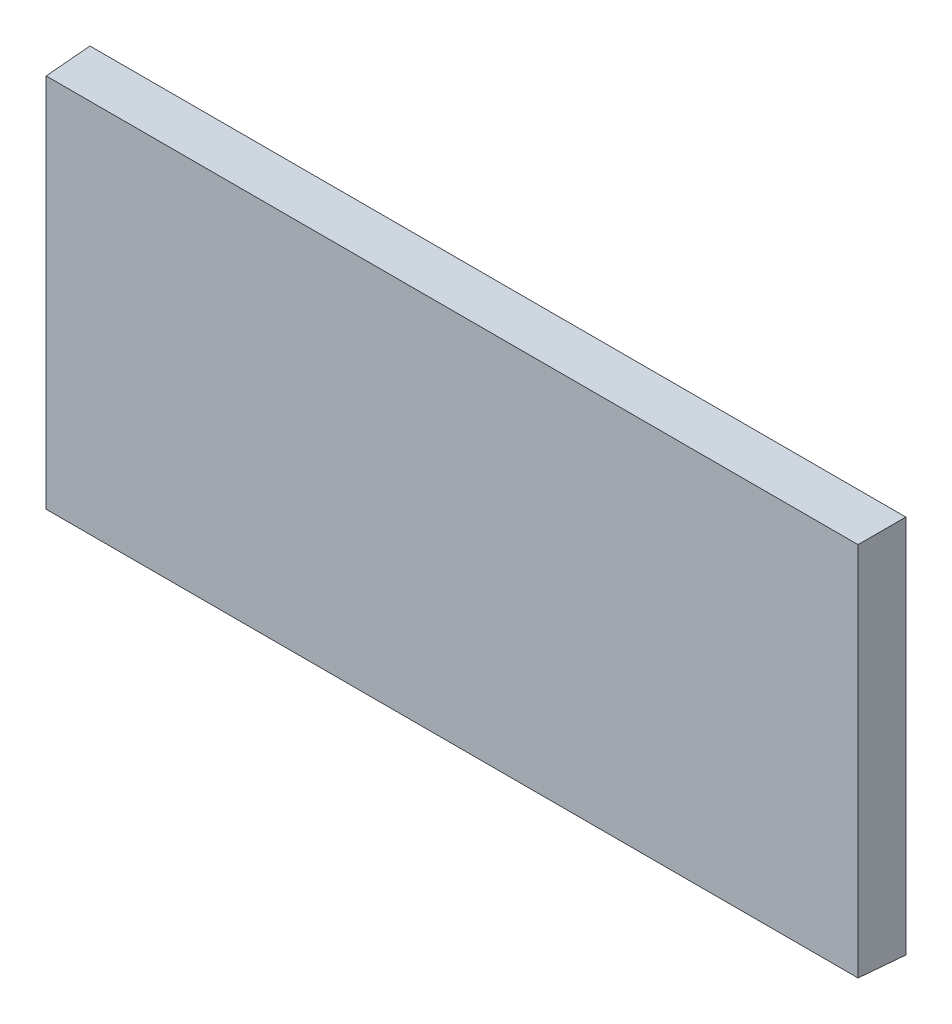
ISO-10303-21;
HEADER;
FILE_DESCRIPTION(('STEP AP214'),'2;1');
FILE_NAME('part.step','',(''),(''),'','','');
FILE_SCHEMA(('AUTOMOTIVE_DESIGN { 1 0 10303 214 1 1 1 1 }'));
ENDSEC;
DATA;
#1=APPLICATION_CONTEXT('core data for automotive mechanical design processes');
#2=APPLICATION_PROTOCOL_DEFINITION('international standard','automotive_design',2000,#1);
#3=PRODUCT_CONTEXT('',#1,'mechanical');
#4=PRODUCT('Part','Part','',(#3));
#5=PRODUCT_RELATED_PRODUCT_CATEGORY('part','',(#4));
#6=PRODUCT_DEFINITION_FORMATION('','',#4);
#7=PRODUCT_DEFINITION_CONTEXT('part definition',#1,'design');
#8=PRODUCT_DEFINITION('design','',#6,#7);
#9=PRODUCT_DEFINITION_SHAPE('','',#8);
#10=(LENGTH_UNIT() NAMED_UNIT(*) SI_UNIT(.MILLI.,.METRE.));
#11=(NAMED_UNIT(*) PLANE_ANGLE_UNIT() SI_UNIT($,.RADIAN.));
#12=(NAMED_UNIT(*) SI_UNIT($,.STERADIAN.) SOLID_ANGLE_UNIT());
#13=UNCERTAINTY_MEASURE_WITH_UNIT(LENGTH_MEASURE(1.E-05),#10,'distance_accuracy_value','');
#14=(GEOMETRIC_REPRESENTATION_CONTEXT(3) GLOBAL_UNCERTAINTY_ASSIGNED_CONTEXT((#13)) GLOBAL_UNIT_ASSIGNED_CONTEXT((#10,
#11,#12)) REPRESENTATION_CONTEXT('',''));
#15=CARTESIAN_POINT('',(0.,0.,0.));
#16=DIRECTION('',(0.,0.,1.));
#17=DIRECTION('',(1.,0.,0.));
#18=AXIS2_PLACEMENT_3D('',#15,#16,#17);
#19=CARTESIAN_POINT('',(0.,55.32,0.));
#20=DIRECTION('',(0.,0.,-1.));
#21=DIRECTION('',(-1.,0.,0.));
#22=AXIS2_PLACEMENT_3D('',#19,#20,#21);
#23=PLANE('',#22);
#24=DIRECTION('',(0.,-1.,0.));
#25=VECTOR('',#24,1.);
#26=CARTESIAN_POINT('',(0.,0.,0.));
#27=LINE('',#26,#25);
#28=CARTESIAN_POINT('',(0.,55.32,0.));
#29=VERTEX_POINT('',#28);
#30=CARTESIAN_POINT('',(0.,0.,0.));
#31=VERTEX_POINT('',#30);
#32=EDGE_CURVE('E127',#29,#31,#27,.T.);
#33=ORIENTED_EDGE('',*,*,#32,.F.);
#34=DIRECTION('',(-1.,0.,0.));
#35=VECTOR('',#34,1.);
#36=CARTESIAN_POINT('',(0.,55.32,0.));
#37=LINE('',#36,#35);
#38=CARTESIAN_POINT('',(119.,55.32,0.));
#39=VERTEX_POINT('',#38);
#40=EDGE_CURVE('E150',#39,#29,#37,.T.);
#41=ORIENTED_EDGE('',*,*,#40,.F.);
#42=DIRECTION('',(0.,1.,0.));
#43=VECTOR('',#42,1.);
#44=CARTESIAN_POINT('',(119.,0.,0.));
#45=LINE('',#44,#43);
#46=CARTESIAN_POINT('',(119.,0.,0.));
#47=VERTEX_POINT('',#46);
#48=EDGE_CURVE('E148',#47,#39,#45,.T.);
#49=ORIENTED_EDGE('',*,*,#48,.F.);
#50=DIRECTION('',(1.,0.,0.));
#51=VECTOR('',#50,1.);
#52=CARTESIAN_POINT('',(0.,0.,0.));
#53=LINE('',#52,#51);
#54=EDGE_CURVE('E131',#31,#47,#53,.T.);
#55=ORIENTED_EDGE('',*,*,#54,.F.);
#56=EDGE_LOOP('',(#33,#41,#49,#55));
#57=FACE_BOUND('',#56,.T.);
#58=DIRECTION('',(1.,0.,0.));
#59=VECTOR('',#58,1.);
#60=CARTESIAN_POINT('',(0.,53.3180946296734,0.));
#61=LINE('',#60,#59);
#62=CARTESIAN_POINT('',(116.998094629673,53.3180946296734,0.));
#63=VERTEX_POINT('',#62);
#64=CARTESIAN_POINT('',(2.00190537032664,53.3180946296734,0.));
#65=VERTEX_POINT('',#64);
#66=EDGE_CURVE('E122',#63,#65,#61,.F.);
#67=ORIENTED_EDGE('',*,*,#66,.T.);
#68=DIRECTION('',(0.,1.,0.));
#69=VECTOR('',#68,1.);
#70=CARTESIAN_POINT('',(2.00190537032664,55.32,0.));
#71=LINE('',#70,#69);
#72=CARTESIAN_POINT('',(2.00190537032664,2.00190537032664,0.));
#73=VERTEX_POINT('',#72);
#74=EDGE_CURVE('E141',#65,#73,#71,.F.);
#75=ORIENTED_EDGE('',*,*,#74,.T.);
#76=DIRECTION('',(-1.,0.,0.));
#77=VECTOR('',#76,1.);
#78=CARTESIAN_POINT('',(0.,2.00190537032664,0.));
#79=LINE('',#78,#77);
#80=CARTESIAN_POINT('',(116.998094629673,2.00190537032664,0.));
#81=VERTEX_POINT('',#80);
#82=EDGE_CURVE('E126',#73,#81,#79,.F.);
#83=ORIENTED_EDGE('',*,*,#82,.T.);
#84=DIRECTION('',(0.,-1.,0.));
#85=VECTOR('',#84,1.);
#86=CARTESIAN_POINT('',(116.998094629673,55.32,0.));
#87=LINE('',#86,#85);
#88=EDGE_CURVE('E54',#81,#63,#87,.F.);
#89=ORIENTED_EDGE('',*,*,#88,.T.);
#90=EDGE_LOOP('',(#67,#75,#83,#89));
#91=FACE_BOUND('',#90,.T.);
#92=ADVANCED_FACE('F37',(#57,#91),#23,.T.);
#93=CARTESIAN_POINT('',(0.,0.,0.));
#94=DIRECTION('',(-0.999048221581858,0.,0.0436193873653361));
#95=DIRECTION('',(0.0436193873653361,0.,0.999048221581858));
#96=AXIS2_PLACEMENT_3D('',#93,#94,#95);
#97=PLANE('',#96);
#98=ORIENTED_EDGE('',*,*,#32,.T.);
#99=DIRECTION('',(-0.0435779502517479,-0.0435779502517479,-0.998099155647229));
#100=VECTOR('',#99,1.);
#101=CARTESIAN_POINT('',(0.,0.,0.));
#102=LINE('',#101,#100);
#103=CARTESIAN_POINT('',(0.291655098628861,0.291655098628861,6.68));
#104=VERTEX_POINT('',#103);
#105=EDGE_CURVE('E11',#104,#31,#102,.T.);
#106=ORIENTED_EDGE('',*,*,#105,.F.);
#107=DIRECTION('',(0.,1.,0.));
#108=VECTOR('',#107,1.);
#109=CARTESIAN_POINT('',(0.291655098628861,55.32,6.68));
#110=LINE('',#109,#108);
#111=CARTESIAN_POINT('',(0.291655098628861,55.0283449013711,6.68));
#112=VERTEX_POINT('',#111);
#113=EDGE_CURVE('E151',#112,#104,#110,.F.);
#114=ORIENTED_EDGE('',*,*,#113,.F.);
#115=DIRECTION('',(-0.0435779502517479,0.0435779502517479,-0.998099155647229));
#116=VECTOR('',#115,1.);
#117=CARTESIAN_POINT('',(0.105054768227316,55.2149452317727,2.40614978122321));
#118=LINE('',#117,#116);
#119=EDGE_CURVE('E153',#112,#29,#118,.T.);
#120=ORIENTED_EDGE('',*,*,#119,.T.);
#121=EDGE_LOOP('',(#98,#106,#114,#120));
#122=FACE_BOUND('',#121,.T.);
#123=ADVANCED_FACE('F178',(#122),#97,.T.);
#124=CARTESIAN_POINT('',(0.,0.,0.));
#125=DIRECTION('',(0.,-0.999048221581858,0.0436193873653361));
#126=DIRECTION('',(0.,-0.0436193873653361,-0.999048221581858));
#127=AXIS2_PLACEMENT_3D('',#124,#125,#126);
#128=PLANE('',#127);
#129=ORIENTED_EDGE('',*,*,#54,.T.);
#130=DIRECTION('',(0.0435779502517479,-0.0435779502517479,-0.998099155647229));
#131=VECTOR('',#130,1.);
#132=CARTESIAN_POINT('',(119.,0.,0.));
#133=LINE('',#132,#131);
#134=CARTESIAN_POINT('',(118.708344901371,0.291655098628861,6.68));
#135=VERTEX_POINT('',#134);
#136=EDGE_CURVE('E46',#135,#47,#133,.T.);
#137=ORIENTED_EDGE('',*,*,#136,.F.);
#138=DIRECTION('',(-1.,0.,0.));
#139=VECTOR('',#138,1.);
#140=CARTESIAN_POINT('',(0.,0.291655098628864,6.68));
#141=LINE('',#140,#139);
#142=EDGE_CURVE('E162',#104,#135,#141,.F.);
#143=ORIENTED_EDGE('',*,*,#142,.F.);
#144=ORIENTED_EDGE('',*,*,#105,.T.);
#145=EDGE_LOOP('',(#129,#137,#143,#144));
#146=FACE_BOUND('',#145,.T.);
#147=ADVANCED_FACE('F39',(#146),#128,.T.);
#148=CARTESIAN_POINT('',(119.,0.,0.));
#149=DIRECTION('',(0.999048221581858,0.,0.0436193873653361));
#150=DIRECTION('',(0.0436193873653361,0.,-0.999048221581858));
#151=AXIS2_PLACEMENT_3D('',#148,#149,#150);
#152=PLANE('',#151);
#153=ORIENTED_EDGE('',*,*,#48,.T.);
#154=DIRECTION('',(0.0435779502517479,0.0435779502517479,-0.998099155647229));
#155=VECTOR('',#154,1.);
#156=CARTESIAN_POINT('',(118.774014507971,55.0940145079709,5.17591872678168));
#157=LINE('',#156,#155);
#158=CARTESIAN_POINT('',(118.708344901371,55.0283449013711,6.68));
#159=VERTEX_POINT('',#158);
#160=EDGE_CURVE('E156',#159,#39,#157,.T.);
#161=ORIENTED_EDGE('',*,*,#160,.F.);
#162=DIRECTION('',(0.,-1.,0.));
#163=VECTOR('',#162,1.);
#164=CARTESIAN_POINT('',(118.708344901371,55.32,6.68));
#165=LINE('',#164,#163);
#166=EDGE_CURVE('E163',#135,#159,#165,.F.);
#167=ORIENTED_EDGE('',*,*,#166,.F.);
#168=ORIENTED_EDGE('',*,*,#136,.T.);
#169=EDGE_LOOP('',(#153,#161,#167,#168));
#170=FACE_BOUND('',#169,.T.);
#171=ADVANCED_FACE('F169',(#170),#152,.T.);
#172=CARTESIAN_POINT('',(0.,55.32,0.));
#173=DIRECTION('',(0.,0.999048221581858,0.0436193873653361));
#174=DIRECTION('',(0.,-0.0436193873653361,0.999048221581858));
#175=AXIS2_PLACEMENT_3D('',#172,#173,#174);
#176=PLANE('',#175);
#177=ORIENTED_EDGE('',*,*,#40,.T.);
#178=ORIENTED_EDGE('',*,*,#119,.F.);
#179=DIRECTION('',(1.,0.,0.));
#180=VECTOR('',#179,1.);
#181=CARTESIAN_POINT('',(0.,55.0283449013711,6.68));
#182=LINE('',#181,#180);
#183=EDGE_CURVE('E41',#159,#112,#182,.F.);
#184=ORIENTED_EDGE('',*,*,#183,.F.);
#185=ORIENTED_EDGE('',*,*,#160,.T.);
#186=EDGE_LOOP('',(#177,#178,#184,#185));
#187=FACE_BOUND('',#186,.T.);
#188=ADVANCED_FACE('F173',(#187),#176,.T.);
#189=CARTESIAN_POINT('',(0.,55.32,6.68));
#190=DIRECTION('',(0.,0.,-1.));
#191=DIRECTION('',(-1.,0.,0.));
#192=AXIS2_PLACEMENT_3D('',#189,#190,#191);
#193=PLANE('',#192);
#194=ORIENTED_EDGE('',*,*,#113,.T.);
#195=ORIENTED_EDGE('',*,*,#142,.T.);
#196=ORIENTED_EDGE('',*,*,#166,.T.);
#197=ORIENTED_EDGE('',*,*,#183,.T.);
#198=EDGE_LOOP('',(#194,#195,#196,#197));
#199=FACE_BOUND('',#198,.T.);
#200=ADVANCED_FACE('F166',(#199),#193,.F.);
#201=CARTESIAN_POINT('',(1.99809644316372,0.,-0.0872387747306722));
#202=DIRECTION('',(-0.999048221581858,0.,0.0436193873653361));
#203=DIRECTION('',(0.0436193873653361,0.,0.999048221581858));
#204=AXIS2_PLACEMENT_3D('',#201,#202,#203);
#205=PLANE('',#204);
#206=ORIENTED_EDGE('',*,*,#74,.F.);
#207=DIRECTION('',(-0.0435779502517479,0.0435779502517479,-0.998099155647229));
#208=VECTOR('',#207,1.);
#209=CARTESIAN_POINT('',(2.09935675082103,53.220643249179,2.2320035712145));
#210=LINE('',#209,#208);
#211=CARTESIAN_POINT('',(2.20623858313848,53.1137614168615,4.68));
#212=VERTEX_POINT('',#211);
#213=EDGE_CURVE('E121',#212,#65,#210,.T.);
#214=ORIENTED_EDGE('',*,*,#213,.F.);
#215=DIRECTION('',(0.,1.,0.));
#216=VECTOR('',#215,1.);
#217=CARTESIAN_POINT('',(2.20623858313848,55.32,4.68));
#218=LINE('',#217,#216);
#219=CARTESIAN_POINT('',(2.20623858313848,2.20623858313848,4.68));
#220=VERTEX_POINT('',#219);
#221=EDGE_CURVE('E109',#212,#220,#218,.F.);
#222=ORIENTED_EDGE('',*,*,#221,.T.);
#223=DIRECTION('',(-0.0435779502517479,-0.0435779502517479,-0.998099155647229));
#224=VECTOR('',#223,1.);
#225=CARTESIAN_POINT('',(1.99430198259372,1.99430198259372,-0.174146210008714));
#226=LINE('',#225,#224);
#227=EDGE_CURVE('E119',#220,#73,#226,.T.);
#228=ORIENTED_EDGE('',*,*,#227,.T.);
#229=EDGE_LOOP('',(#206,#214,#222,#228));
#230=FACE_BOUND('',#229,.T.);
#231=ADVANCED_FACE('F118',(#230),#205,.F.);
#232=CARTESIAN_POINT('',(0.,1.99809644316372,-0.0872387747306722));
#233=DIRECTION('',(0.,-0.999048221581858,0.0436193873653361));
#234=DIRECTION('',(0.,-0.0436193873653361,-0.999048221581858));
#235=AXIS2_PLACEMENT_3D('',#232,#233,#234);
#236=PLANE('',#235);
#237=ORIENTED_EDGE('',*,*,#82,.F.);
#238=ORIENTED_EDGE('',*,*,#227,.F.);
#239=DIRECTION('',(-1.,0.,0.));
#240=VECTOR('',#239,1.);
#241=CARTESIAN_POINT('',(0.,2.20623858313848,4.68));
#242=LINE('',#241,#240);
#243=CARTESIAN_POINT('',(116.793761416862,2.20623858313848,4.68));
#244=VERTEX_POINT('',#243);
#245=EDGE_CURVE('E105',#220,#244,#242,.F.);
#246=ORIENTED_EDGE('',*,*,#245,.T.);
#247=DIRECTION('',(0.0435779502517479,-0.0435779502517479,-0.998099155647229));
#248=VECTOR('',#247,1.);
#249=CARTESIAN_POINT('',(117.005698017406,1.99430198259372,-0.174146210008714));
#250=LINE('',#249,#248);
#251=EDGE_CURVE('E128',#244,#81,#250,.T.);
#252=ORIENTED_EDGE('',*,*,#251,.T.);
#253=EDGE_LOOP('',(#237,#238,#246,#252));
#254=FACE_BOUND('',#253,.T.);
#255=ADVANCED_FACE('F124',(#254),#236,.F.);
#256=CARTESIAN_POINT('',(117.001903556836,0.,-0.0872387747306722));
#257=DIRECTION('',(0.999048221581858,0.,0.0436193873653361));
#258=DIRECTION('',(0.0436193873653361,0.,-0.999048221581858));
#259=AXIS2_PLACEMENT_3D('',#256,#257,#258);
#260=PLANE('',#259);
#261=ORIENTED_EDGE('',*,*,#88,.F.);
#262=ORIENTED_EDGE('',*,*,#251,.F.);
#263=DIRECTION('',(0.,-1.,0.));
#264=VECTOR('',#263,1.);
#265=CARTESIAN_POINT('',(116.793761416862,55.32,4.68));
#266=LINE('',#265,#264);
#267=CARTESIAN_POINT('',(116.793761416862,53.1137614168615,4.68));
#268=VERTEX_POINT('',#267);
#269=EDGE_CURVE('E110',#244,#268,#266,.F.);
#270=ORIENTED_EDGE('',*,*,#269,.T.);
#271=DIRECTION('',(0.0435779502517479,0.0435779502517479,-0.998099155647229));
#272=VECTOR('',#271,1.);
#273=CARTESIAN_POINT('',(116.779712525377,53.0997125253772,5.00177251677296));
#274=LINE('',#273,#272);
#275=EDGE_CURVE('E133',#268,#63,#274,.T.);
#276=ORIENTED_EDGE('',*,*,#275,.T.);
#277=EDGE_LOOP('',(#261,#262,#270,#276));
#278=FACE_BOUND('',#277,.T.);
#279=ADVANCED_FACE('F188',(#278),#260,.F.);
#280=CARTESIAN_POINT('',(0.,53.3219035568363,-0.0872387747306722));
#281=DIRECTION('',(0.,0.999048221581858,0.0436193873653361));
#282=DIRECTION('',(0.,-0.0436193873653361,0.999048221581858));
#283=AXIS2_PLACEMENT_3D('',#280,#281,#282);
#284=PLANE('',#283);
#285=ORIENTED_EDGE('',*,*,#66,.F.);
#286=ORIENTED_EDGE('',*,*,#275,.F.);
#287=DIRECTION('',(1.,0.,0.));
#288=VECTOR('',#287,1.);
#289=CARTESIAN_POINT('',(0.,53.1137614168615,4.68));
#290=LINE('',#289,#288);
#291=EDGE_CURVE('E136',#268,#212,#290,.F.);
#292=ORIENTED_EDGE('',*,*,#291,.T.);
#293=ORIENTED_EDGE('',*,*,#213,.T.);
#294=EDGE_LOOP('',(#285,#286,#292,#293));
#295=FACE_BOUND('',#294,.T.);
#296=ADVANCED_FACE('F187',(#295),#284,.F.);
#297=CARTESIAN_POINT('',(0.,55.32,4.68));
#298=DIRECTION('',(0.,0.,-1.));
#299=DIRECTION('',(-1.,0.,0.));
#300=AXIS2_PLACEMENT_3D('',#297,#298,#299);
#301=PLANE('',#300);
#302=ORIENTED_EDGE('',*,*,#221,.F.);
#303=ORIENTED_EDGE('',*,*,#291,.F.);
#304=ORIENTED_EDGE('',*,*,#269,.F.);
#305=ORIENTED_EDGE('',*,*,#245,.F.);
#306=EDGE_LOOP('',(#302,#303,#304,#305));
#307=FACE_BOUND('',#306,.T.);
#308=ADVANCED_FACE('F107',(#307),#301,.T.);
#309=CLOSED_SHELL('',(#92,#123,#147,#171,#188,#200,#231,#255,#279,#296,#308));
#310=MANIFOLD_SOLID_BREP('B2',#309);
#311=ADVANCED_BREP_SHAPE_REPRESENTATION('',(#18,#310),#14);
#312=SHAPE_DEFINITION_REPRESENTATION(#9,#311);
ENDSEC;
END-ISO-10303-21;
